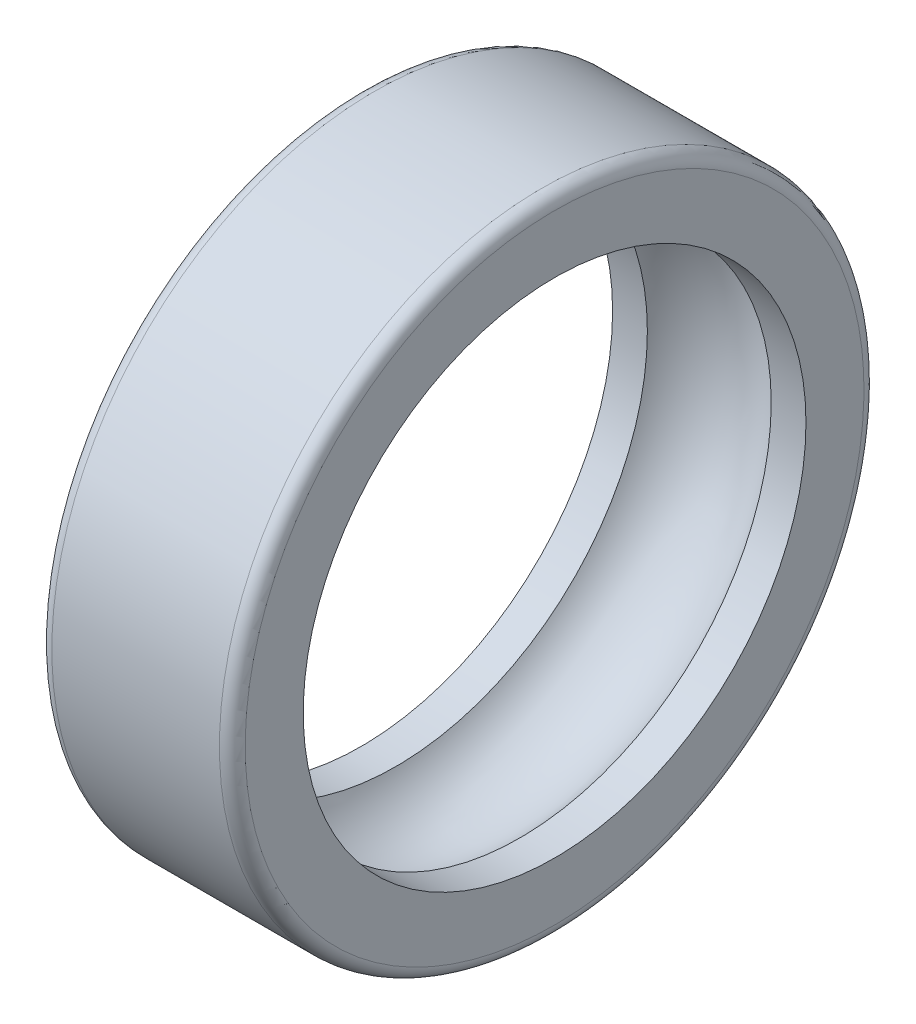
ISO-10303-21;
HEADER;
FILE_DESCRIPTION(('STEP AP214'),'2;1');
FILE_NAME('part.step','',(''),(''),'','','');
FILE_SCHEMA(('AUTOMOTIVE_DESIGN { 1 0 10303 214 1 1 1 1 }'));
ENDSEC;
DATA;
#1=APPLICATION_CONTEXT('core data for automotive mechanical design processes');
#2=APPLICATION_PROTOCOL_DEFINITION('international standard','automotive_design',2000,#1);
#3=PRODUCT_CONTEXT('',#1,'mechanical');
#4=PRODUCT('Part','Part','',(#3));
#5=PRODUCT_RELATED_PRODUCT_CATEGORY('part','',(#4));
#6=PRODUCT_DEFINITION_FORMATION('','',#4);
#7=PRODUCT_DEFINITION_CONTEXT('part definition',#1,'design');
#8=PRODUCT_DEFINITION('design','',#6,#7);
#9=PRODUCT_DEFINITION_SHAPE('','',#8);
#10=(LENGTH_UNIT() NAMED_UNIT(*) SI_UNIT(.MILLI.,.METRE.));
#11=(NAMED_UNIT(*) PLANE_ANGLE_UNIT() SI_UNIT($,.RADIAN.));
#12=(NAMED_UNIT(*) SI_UNIT($,.STERADIAN.) SOLID_ANGLE_UNIT());
#13=UNCERTAINTY_MEASURE_WITH_UNIT(LENGTH_MEASURE(1.E-05),#10,'distance_accuracy_value','');
#14=(GEOMETRIC_REPRESENTATION_CONTEXT(3) GLOBAL_UNCERTAINTY_ASSIGNED_CONTEXT((#13)) GLOBAL_UNIT_ASSIGNED_CONTEXT((#10,
#11,#12)) REPRESENTATION_CONTEXT('',''));
#15=CARTESIAN_POINT('',(0.,0.,0.));
#16=DIRECTION('',(0.,0.,1.));
#17=DIRECTION('',(1.,0.,0.));
#18=AXIS2_PLACEMENT_3D('',#15,#16,#17);
#19=CARTESIAN_POINT('',(4.5,0.,0.));
#20=DIRECTION('',(1.,0.,0.));
#21=DIRECTION('',(0.,0.877582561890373,0.479425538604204));
#22=AXIS2_PLACEMENT_3D('',#19,#20,#21);
#23=TOROIDAL_SURFACE('',#22,10.025,3.33333333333);
#24=CARTESIAN_POINT('',(7.38192402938,0.,0.));
#25=DIRECTION('',(1.,0.,0.));
#26=DIRECTION('',(0.,0.,-1.));
#27=AXIS2_PLACEMENT_3D('',#24,#25,#26);
#28=CIRCLE('',#27,11.7);
#29=CARTESIAN_POINT('',(7.38192402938,0.,-11.7));
#30=VERTEX_POINT('',#29);
#31=EDGE_CURVE('E192',#30,#30,#28,.T.);
#32=ORIENTED_EDGE('',*,*,#31,.T.);
#33=EDGE_LOOP('',(#32));
#34=FACE_BOUND('',#33,.T.);
#35=CARTESIAN_POINT('',(1.61807597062,0.,0.));
#36=DIRECTION('',(1.,0.,0.));
#37=DIRECTION('',(0.,0.,-1.));
#38=AXIS2_PLACEMENT_3D('',#35,#36,#37);
#39=CIRCLE('',#38,11.7);
#40=CARTESIAN_POINT('',(1.61807597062,0.,-11.7));
#41=VERTEX_POINT('',#40);
#42=EDGE_CURVE('E62',#41,#41,#39,.F.);
#43=ORIENTED_EDGE('',*,*,#42,.T.);
#44=EDGE_LOOP('',(#43));
#45=FACE_BOUND('',#44,.T.);
#46=ADVANCED_FACE('F15',(#34,#45),#23,.F.);
#47=CARTESIAN_POINT('',(4.5,0.,0.));
#48=DIRECTION('',(1.,0.,0.));
#49=DIRECTION('',(0.,0.,-1.));
#50=AXIS2_PLACEMENT_3D('',#47,#48,#49);
#51=CYLINDRICAL_SURFACE('',#50,11.7);
#52=CARTESIAN_POINT('',(9.,0.,0.));
#53=DIRECTION('',(1.,0.,0.));
#54=DIRECTION('',(0.,0.,-1.));
#55=AXIS2_PLACEMENT_3D('',#52,#53,#54);
#56=CIRCLE('',#55,11.7);
#57=CARTESIAN_POINT('',(9.,0.,-11.7));
#58=VERTEX_POINT('',#57);
#59=EDGE_CURVE('E188',#58,#58,#56,.F.);
#60=ORIENTED_EDGE('',*,*,#59,.F.);
#61=EDGE_LOOP('',(#60));
#62=FACE_BOUND('',#61,.T.);
#63=ORIENTED_EDGE('',*,*,#31,.F.);
#64=EDGE_LOOP('',(#63));
#65=FACE_BOUND('',#64,.T.);
#66=ADVANCED_FACE('F133',(#62,#65),#51,.F.);
#67=CARTESIAN_POINT('',(4.5,0.,0.));
#68=DIRECTION('',(1.,0.,0.));
#69=DIRECTION('',(0.,0.,-1.));
#70=AXIS2_PLACEMENT_3D('',#67,#68,#69);
#71=CYLINDRICAL_SURFACE('',#70,11.7);
#72=ORIENTED_EDGE('',*,*,#42,.F.);
#73=EDGE_LOOP('',(#72));
#74=FACE_BOUND('',#73,.T.);
#75=CARTESIAN_POINT('',(0.,0.,0.));
#76=DIRECTION('',(1.,0.,0.));
#77=DIRECTION('',(0.,0.,-1.));
#78=AXIS2_PLACEMENT_3D('',#75,#76,#77);
#79=CIRCLE('',#78,11.7);
#80=CARTESIAN_POINT('',(0.,0.,-11.7));
#81=VERTEX_POINT('',#80);
#82=EDGE_CURVE('E51',#81,#81,#79,.F.);
#83=ORIENTED_EDGE('',*,*,#82,.T.);
#84=EDGE_LOOP('',(#83));
#85=FACE_BOUND('',#84,.T.);
#86=ADVANCED_FACE('F118',(#74,#85),#71,.F.);
#87=CARTESIAN_POINT('',(9.,11.7,0.));
#88=DIRECTION('',(1.,0.,0.));
#89=DIRECTION('',(0.,0.,-1.));
#90=AXIS2_PLACEMENT_3D('',#87,#88,#89);
#91=PLANE('',#90);
#92=ORIENTED_EDGE('',*,*,#59,.T.);
#93=EDGE_LOOP('',(#92));
#94=FACE_BOUND('',#93,.T.);
#95=CARTESIAN_POINT('',(9.,0.,0.));
#96=DIRECTION('',(-1.,0.,0.));
#97=DIRECTION('',(0.,0.877582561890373,0.479425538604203));
#98=AXIS2_PLACEMENT_3D('',#95,#96,#97);
#99=CIRCLE('',#98,14.3999999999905);
#100=CARTESIAN_POINT('',(9.,12.6371888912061,6.90372775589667));
#101=VERTEX_POINT('',#100);
#102=CARTESIAN_POINT('',(9.,-12.6371888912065,-6.90372775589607));
#103=VERTEX_POINT('',#102);
#104=EDGE_CURVE('E44',#101,#103,#99,.T.);
#105=ORIENTED_EDGE('',*,*,#104,.F.);
#106=CARTESIAN_POINT('',(9.,0.,0.));
#107=DIRECTION('',(-1.,0.,0.));
#108=DIRECTION('',(0.,-0.877582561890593,-0.4794255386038));
#109=AXIS2_PLACEMENT_3D('',#106,#107,#108);
#110=CIRCLE('',#109,14.399999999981);
#111=EDGE_CURVE('E47',#103,#101,#110,.T.);
#112=ORIENTED_EDGE('',*,*,#111,.F.);
#113=EDGE_LOOP('',(#105,#112));
#114=FACE_BOUND('',#113,.T.);
#115=ADVANCED_FACE('F49',(#94,#114),#91,.T.);
#116=CARTESIAN_POINT('',(0.,14.4,0.));
#117=DIRECTION('',(1.,0.,0.));
#118=DIRECTION('',(0.,0.,-1.));
#119=AXIS2_PLACEMENT_3D('',#116,#117,#118);
#120=PLANE('',#119);
#121=ORIENTED_EDGE('',*,*,#82,.F.);
#122=EDGE_LOOP('',(#121));
#123=FACE_BOUND('',#122,.T.);
#124=CARTESIAN_POINT('',(0.,0.,0.));
#125=DIRECTION('',(1.,0.,0.));
#126=DIRECTION('',(0.,-0.877582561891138,-0.479425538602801));
#127=AXIS2_PLACEMENT_3D('',#124,#125,#126);
#128=CIRCLE('',#127,14.3999999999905);
#129=CARTESIAN_POINT('',(0.,-12.6371888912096,-6.90372775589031));
#130=VERTEX_POINT('',#129);
#131=CARTESIAN_POINT('',(0.,12.6371888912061,6.90372775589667));
#132=VERTEX_POINT('',#131);
#133=EDGE_CURVE('E56',#130,#132,#128,.T.);
#134=ORIENTED_EDGE('',*,*,#133,.F.);
#135=CARTESIAN_POINT('',(0.,0.,0.));
#136=DIRECTION('',(1.,0.,0.));
#137=DIRECTION('',(0.,0.877582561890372,0.479425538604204));
#138=AXIS2_PLACEMENT_3D('',#135,#136,#137);
#139=CIRCLE('',#138,14.399999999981);
#140=EDGE_CURVE('E35',#132,#130,#139,.T.);
#141=ORIENTED_EDGE('',*,*,#140,.F.);
#142=EDGE_LOOP('',(#134,#141));
#143=FACE_BOUND('',#142,.T.);
#144=ADVANCED_FACE('F74',(#123,#143),#120,.F.);
#145=CARTESIAN_POINT('',(8.4,0.,0.));
#146=DIRECTION('',(1.,0.,0.));
#147=DIRECTION('',(0.,0.877582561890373,0.479425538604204));
#148=AXIS2_PLACEMENT_3D('',#145,#146,#147);
#149=TOROIDAL_SURFACE('',#148,14.4,0.6);
#150=CARTESIAN_POINT('',(8.4,0.,0.));
#151=DIRECTION('',(1.,0.,0.));
#152=DIRECTION('',(0.,0.,-1.));
#153=AXIS2_PLACEMENT_3D('',#150,#151,#152);
#154=CIRCLE('',#153,15.);
#155=CARTESIAN_POINT('',(8.4,0.,-15.));
#156=VERTEX_POINT('',#155);
#157=EDGE_CURVE('E27',#156,#156,#154,.F.);
#158=ORIENTED_EDGE('',*,*,#157,.F.);
#159=EDGE_LOOP('',(#158));
#160=FACE_BOUND('',#159,.T.);
#161=ORIENTED_EDGE('',*,*,#104,.T.);
#162=ORIENTED_EDGE('',*,*,#111,.T.);
#163=EDGE_LOOP('',(#161,#162));
#164=FACE_BOUND('',#163,.T.);
#165=ADVANCED_FACE('F55',(#160,#164),#149,.T.);
#166=CARTESIAN_POINT('',(0.6,0.,0.));
#167=DIRECTION('',(1.,0.,0.));
#168=DIRECTION('',(0.,0.877582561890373,0.479425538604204));
#169=AXIS2_PLACEMENT_3D('',#166,#167,#168);
#170=TOROIDAL_SURFACE('',#169,14.4,0.6);
#171=ORIENTED_EDGE('',*,*,#140,.T.);
#172=ORIENTED_EDGE('',*,*,#133,.T.);
#173=EDGE_LOOP('',(#171,#172));
#174=FACE_BOUND('',#173,.T.);
#175=CARTESIAN_POINT('',(0.6,0.,0.));
#176=DIRECTION('',(1.,0.,0.));
#177=DIRECTION('',(0.,0.,-1.));
#178=AXIS2_PLACEMENT_3D('',#175,#176,#177);
#179=CIRCLE('',#178,15.);
#180=CARTESIAN_POINT('',(0.6,0.,-15.));
#181=VERTEX_POINT('',#180);
#182=EDGE_CURVE('E10',#181,#181,#179,.T.);
#183=ORIENTED_EDGE('',*,*,#182,.F.);
#184=EDGE_LOOP('',(#183));
#185=FACE_BOUND('',#184,.T.);
#186=ADVANCED_FACE('F73',(#174,#185),#170,.T.);
#187=CARTESIAN_POINT('',(4.5,0.,0.));
#188=DIRECTION('',(1.,0.,0.));
#189=DIRECTION('',(0.,0.,-1.));
#190=AXIS2_PLACEMENT_3D('',#187,#188,#189);
#191=CYLINDRICAL_SURFACE('',#190,15.);
#192=ORIENTED_EDGE('',*,*,#182,.T.);
#193=EDGE_LOOP('',(#192));
#194=FACE_BOUND('',#193,.T.);
#195=ORIENTED_EDGE('',*,*,#157,.T.);
#196=EDGE_LOOP('',(#195));
#197=FACE_BOUND('',#196,.T.);
#198=ADVANCED_FACE('F17',(#194,#197),#191,.T.);
#199=CLOSED_SHELL('',(#46,#66,#86,#115,#144,#165,#186,#198));
#200=MANIFOLD_SOLID_BREP('B1',#199);
#201=ADVANCED_BREP_SHAPE_REPRESENTATION('',(#18,#200),#14);
#202=SHAPE_DEFINITION_REPRESENTATION(#9,#201);
ENDSEC;
END-ISO-10303-21;
